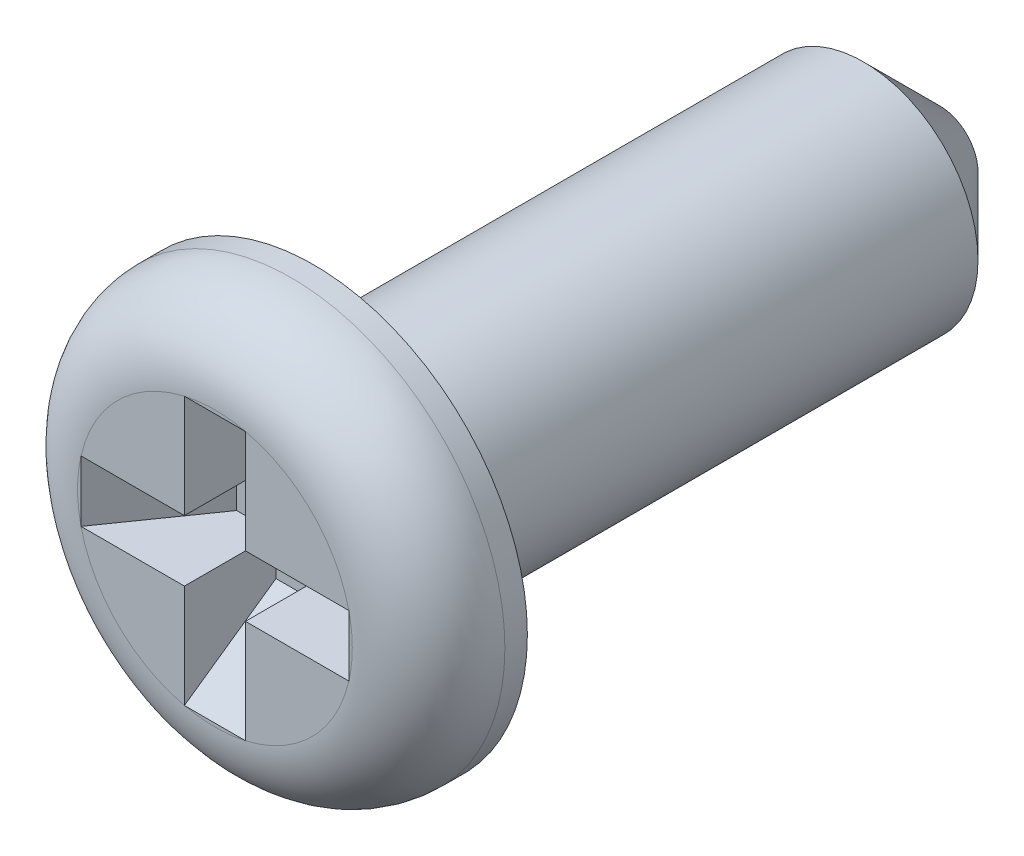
ISO-10303-21;
HEADER;
FILE_DESCRIPTION(('STEP AP214'),'2;1');
FILE_NAME('part.step','',(''),(''),'','','');
FILE_SCHEMA(('AUTOMOTIVE_DESIGN { 1 0 10303 214 1 1 1 1 }'));
ENDSEC;
DATA;
#1=APPLICATION_CONTEXT('core data for automotive mechanical design processes');
#2=APPLICATION_PROTOCOL_DEFINITION('international standard','automotive_design',2000,#1);
#3=PRODUCT_CONTEXT('',#1,'mechanical');
#4=PRODUCT('Part','Part','',(#3));
#5=PRODUCT_RELATED_PRODUCT_CATEGORY('part','',(#4));
#6=PRODUCT_DEFINITION_FORMATION('','',#4);
#7=PRODUCT_DEFINITION_CONTEXT('part definition',#1,'design');
#8=PRODUCT_DEFINITION('design','',#6,#7);
#9=PRODUCT_DEFINITION_SHAPE('','',#8);
#10=(LENGTH_UNIT() NAMED_UNIT(*) SI_UNIT(.MILLI.,.METRE.));
#11=(NAMED_UNIT(*) PLANE_ANGLE_UNIT() SI_UNIT($,.RADIAN.));
#12=(NAMED_UNIT(*) SI_UNIT($,.STERADIAN.) SOLID_ANGLE_UNIT());
#13=UNCERTAINTY_MEASURE_WITH_UNIT(LENGTH_MEASURE(1.E-05),#10,'distance_accuracy_value','');
#14=(GEOMETRIC_REPRESENTATION_CONTEXT(3) GLOBAL_UNCERTAINTY_ASSIGNED_CONTEXT((#13)) GLOBAL_UNIT_ASSIGNED_CONTEXT((#10,
#11,#12)) REPRESENTATION_CONTEXT('',''));
#15=CARTESIAN_POINT('',(0.,0.,0.));
#16=DIRECTION('',(0.,0.,1.));
#17=DIRECTION('',(1.,0.,0.));
#18=AXIS2_PLACEMENT_3D('',#15,#16,#17);
#19=CARTESIAN_POINT('',(0.,1.79999999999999,0.));
#20=DIRECTION('',(0.,0.,-1.));
#21=DIRECTION('',(-1.,0.,0.));
#22=AXIS2_PLACEMENT_3D('',#19,#20,#21);
#23=PLANE('',#22);
#24=CARTESIAN_POINT('',(0.,0.,0.));
#25=DIRECTION('',(0.,0.,1.));
#26=DIRECTION('',(1.,0.,0.));
#27=AXIS2_PLACEMENT_3D('',#24,#25,#26);
#28=CIRCLE('',#27,1.79999999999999);
#29=CARTESIAN_POINT('',(-1.75499287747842,0.4,0.));
#30=VERTEX_POINT('',#29);
#31=CARTESIAN_POINT('',(-1.75499287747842,-0.399999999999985,0.));
#32=VERTEX_POINT('',#31);
#33=EDGE_CURVE('E191',#30,#32,#28,.T.);
#34=ORIENTED_EDGE('',*,*,#33,.T.);
#35=DIRECTION('',(0.,1.,0.));
#36=VECTOR('',#35,1.);
#37=CARTESIAN_POINT('',(-1.75499287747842,1.79999999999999,0.));
#38=LINE('',#37,#36);
#39=EDGE_CURVE('E43',#30,#32,#38,.F.);
#40=ORIENTED_EDGE('',*,*,#39,.F.);
#41=EDGE_LOOP('',(#34,#40));
#42=FACE_BOUND('',#41,.T.);
#43=ADVANCED_FACE('F26',(#42),#23,.F.);
#44=CARTESIAN_POINT('',(-0.399999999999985,1.75499287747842,0.));
#45=VERTEX_POINT('',#44);
#46=EDGE_CURVE('E299',#45,#30,#28,.T.);
#47=ORIENTED_EDGE('',*,*,#46,.T.);
#48=DIRECTION('',(-1.,0.,0.));
#49=VECTOR('',#48,1.);
#50=CARTESIAN_POINT('',(-1.75499287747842,0.4,0.));
#51=LINE('',#50,#49);
#52=CARTESIAN_POINT('',(-0.4,0.4,0.));
#53=VERTEX_POINT('',#52);
#54=EDGE_CURVE('E150',#53,#30,#51,.T.);
#55=ORIENTED_EDGE('',*,*,#54,.F.);
#56=DIRECTION('',(0.,-1.,0.));
#57=VECTOR('',#56,1.);
#58=CARTESIAN_POINT('',(-0.4,1.75499287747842,0.));
#59=LINE('',#58,#57);
#60=EDGE_CURVE('E199',#45,#53,#59,.T.);
#61=ORIENTED_EDGE('',*,*,#60,.F.);
#62=EDGE_LOOP('',(#47,#55,#61));
#63=FACE_BOUND('',#62,.T.);
#64=ADVANCED_FACE('F253',(#63),#23,.F.);
#65=CARTESIAN_POINT('',(0.4,1.75499287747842,0.));
#66=VERTEX_POINT('',#65);
#67=EDGE_CURVE('E301',#66,#45,#28,.T.);
#68=ORIENTED_EDGE('',*,*,#67,.T.);
#69=DIRECTION('',(1.,0.,0.));
#70=VECTOR('',#69,1.);
#71=CARTESIAN_POINT('',(0.,1.75499287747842,0.));
#72=LINE('',#71,#70);
#73=EDGE_CURVE('E211',#66,#45,#72,.F.);
#74=ORIENTED_EDGE('',*,*,#73,.F.);
#75=EDGE_LOOP('',(#68,#74));
#76=FACE_BOUND('',#75,.T.);
#77=ADVANCED_FACE('F261',(#76),#23,.F.);
#78=CARTESIAN_POINT('',(1.75499287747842,0.399999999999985,0.));
#79=VERTEX_POINT('',#78);
#80=EDGE_CURVE('E190',#79,#66,#28,.T.);
#81=ORIENTED_EDGE('',*,*,#80,.T.);
#82=DIRECTION('',(0.,1.,0.));
#83=VECTOR('',#82,1.);
#84=CARTESIAN_POINT('',(0.4,1.75499287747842,0.));
#85=LINE('',#84,#83);
#86=CARTESIAN_POINT('',(0.4,0.4,0.));
#87=VERTEX_POINT('',#86);
#88=EDGE_CURVE('E208',#87,#66,#85,.T.);
#89=ORIENTED_EDGE('',*,*,#88,.F.);
#90=DIRECTION('',(-1.,0.,0.));
#91=VECTOR('',#90,1.);
#92=CARTESIAN_POINT('',(0.4,0.4,0.));
#93=LINE('',#92,#91);
#94=EDGE_CURVE('E212',#79,#87,#93,.T.);
#95=ORIENTED_EDGE('',*,*,#94,.F.);
#96=EDGE_LOOP('',(#81,#89,#95));
#97=FACE_BOUND('',#96,.T.);
#98=ADVANCED_FACE('F318',(#97),#23,.F.);
#99=CARTESIAN_POINT('',(1.75499287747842,-0.4,0.));
#100=VERTEX_POINT('',#99);
#101=EDGE_CURVE('E184',#100,#79,#28,.T.);
#102=ORIENTED_EDGE('',*,*,#101,.T.);
#103=DIRECTION('',(0.,-1.,0.));
#104=VECTOR('',#103,1.);
#105=CARTESIAN_POINT('',(1.75499287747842,1.79999999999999,0.));
#106=LINE('',#105,#104);
#107=EDGE_CURVE('E216',#100,#79,#106,.F.);
#108=ORIENTED_EDGE('',*,*,#107,.F.);
#109=EDGE_LOOP('',(#102,#108));
#110=FACE_BOUND('',#109,.T.);
#111=ADVANCED_FACE('F288',(#110),#23,.F.);
#112=CARTESIAN_POINT('',(0.399999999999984,-1.75499287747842,0.));
#113=VERTEX_POINT('',#112);
#114=EDGE_CURVE('E189',#113,#100,#28,.T.);
#115=ORIENTED_EDGE('',*,*,#114,.T.);
#116=DIRECTION('',(1.,0.,0.));
#117=VECTOR('',#116,1.);
#118=CARTESIAN_POINT('',(0.4,-0.4,0.));
#119=LINE('',#118,#117);
#120=CARTESIAN_POINT('',(0.4,-0.4,0.));
#121=VERTEX_POINT('',#120);
#122=EDGE_CURVE('E207',#121,#100,#119,.T.);
#123=ORIENTED_EDGE('',*,*,#122,.F.);
#124=DIRECTION('',(0.,1.,0.));
#125=VECTOR('',#124,1.);
#126=CARTESIAN_POINT('',(0.4,-0.4,0.));
#127=LINE('',#126,#125);
#128=EDGE_CURVE('E204',#113,#121,#127,.T.);
#129=ORIENTED_EDGE('',*,*,#128,.F.);
#130=EDGE_LOOP('',(#115,#123,#129));
#131=FACE_BOUND('',#130,.T.);
#132=ADVANCED_FACE('F281',(#131),#23,.F.);
#133=CARTESIAN_POINT('',(-0.4,-1.75499287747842,0.));
#134=VERTEX_POINT('',#133);
#135=EDGE_CURVE('E185',#134,#113,#28,.T.);
#136=ORIENTED_EDGE('',*,*,#135,.T.);
#137=DIRECTION('',(-1.,0.,0.));
#138=VECTOR('',#137,1.);
#139=CARTESIAN_POINT('',(0.,-1.75499287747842,0.));
#140=LINE('',#139,#138);
#141=EDGE_CURVE('E203',#134,#113,#140,.F.);
#142=ORIENTED_EDGE('',*,*,#141,.F.);
#143=EDGE_LOOP('',(#136,#142));
#144=FACE_BOUND('',#143,.T.);
#145=ADVANCED_FACE('F269',(#144),#23,.F.);
#146=CARTESIAN_POINT('',(0.,2.8,-1.29465791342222));
#147=DIRECTION('',(0.,0.,1.));
#148=DIRECTION('',(1.,0.,0.));
#149=AXIS2_PLACEMENT_3D('',#146,#147,#148);
#150=PLANE('',#149);
#151=CARTESIAN_POINT('',(0.,0.,-1.29465791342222));
#152=DIRECTION('',(0.,0.,1.));
#153=DIRECTION('',(1.,0.,0.));
#154=AXIS2_PLACEMENT_3D('',#151,#152,#153);
#155=CIRCLE('',#154,1.5);
#156=CARTESIAN_POINT('',(1.5,0.,-1.29465791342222));
#157=VERTEX_POINT('',#156);
#158=EDGE_CURVE('E181',#157,#157,#155,.T.);
#159=ORIENTED_EDGE('',*,*,#158,.T.);
#160=EDGE_LOOP('',(#159));
#161=FACE_BOUND('',#160,.T.);
#162=CARTESIAN_POINT('',(0.,0.,-1.29465791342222));
#163=DIRECTION('',(0.,0.,1.));
#164=DIRECTION('',(1.,0.,0.));
#165=AXIS2_PLACEMENT_3D('',#162,#163,#164);
#166=CIRCLE('',#165,2.8);
#167=CARTESIAN_POINT('',(2.8,0.,-1.29465791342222));
#168=VERTEX_POINT('',#167);
#169=EDGE_CURVE('E195',#168,#168,#166,.T.);
#170=ORIENTED_EDGE('',*,*,#169,.F.);
#171=EDGE_LOOP('',(#170));
#172=FACE_BOUND('',#171,.T.);
#173=ADVANCED_FACE('F280',(#161,#172),#150,.F.);
#174=CARTESIAN_POINT('',(0.,0.,1.60350842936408));
#175=DIRECTION('',(0.,0.,1.));
#176=DIRECTION('',(1.,0.,0.));
#177=AXIS2_PLACEMENT_3D('',#174,#175,#176);
#178=CYLINDRICAL_SURFACE('',#177,2.8);
#179=CARTESIAN_POINT('',(0.,0.,-1.00000000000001));
#180=DIRECTION('',(0.,0.,1.));
#181=DIRECTION('',(1.,0.,0.));
#182=AXIS2_PLACEMENT_3D('',#179,#180,#181);
#183=CIRCLE('',#182,2.8);
#184=CARTESIAN_POINT('',(2.8,0.,-1.00000000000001));
#185=VERTEX_POINT('',#184);
#186=EDGE_CURVE('E192',#185,#185,#183,.T.);
#187=ORIENTED_EDGE('',*,*,#186,.F.);
#188=EDGE_LOOP('',(#187));
#189=FACE_BOUND('',#188,.T.);
#190=ORIENTED_EDGE('',*,*,#169,.T.);
#191=EDGE_LOOP('',(#190));
#192=FACE_BOUND('',#191,.T.);
#193=ADVANCED_FACE('F276',(#189,#192),#178,.T.);
#194=CARTESIAN_POINT('',(0.,0.,-1.));
#195=DIRECTION('',(0.,0.,1.));
#196=DIRECTION('',(1.,0.,0.));
#197=AXIS2_PLACEMENT_3D('',#194,#195,#196);
#198=TOROIDAL_SURFACE('',#197,1.8,1.);
#199=ORIENTED_EDGE('',*,*,#80,.F.);
#200=ORIENTED_EDGE('',*,*,#101,.F.);
#201=ORIENTED_EDGE('',*,*,#114,.F.);
#202=ORIENTED_EDGE('',*,*,#135,.F.);
#203=EDGE_CURVE('E188',#32,#134,#28,.T.);
#204=ORIENTED_EDGE('',*,*,#203,.F.);
#205=ORIENTED_EDGE('',*,*,#33,.F.);
#206=ORIENTED_EDGE('',*,*,#46,.F.);
#207=ORIENTED_EDGE('',*,*,#67,.F.);
#208=EDGE_LOOP('',(#199,#200,#201,#202,#204,#205,#206,#207));
#209=FACE_BOUND('',#208,.T.);
#210=ORIENTED_EDGE('',*,*,#186,.T.);
#211=EDGE_LOOP('',(#210));
#212=FACE_BOUND('',#211,.T.);
#213=ADVANCED_FACE('F267',(#209,#212),#198,.T.);
#214=ORIENTED_EDGE('',*,*,#203,.T.);
#215=DIRECTION('',(0.,-1.,0.));
#216=VECTOR('',#215,1.);
#217=CARTESIAN_POINT('',(-0.4,-0.4,0.));
#218=LINE('',#217,#216);
#219=CARTESIAN_POINT('',(-0.4,-0.4,0.));
#220=VERTEX_POINT('',#219);
#221=EDGE_CURVE('E201',#220,#134,#218,.T.);
#222=ORIENTED_EDGE('',*,*,#221,.F.);
#223=DIRECTION('',(1.,0.,0.));
#224=VECTOR('',#223,1.);
#225=CARTESIAN_POINT('',(-1.75499287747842,-0.4,0.));
#226=LINE('',#225,#224);
#227=EDGE_CURVE('E131',#32,#220,#226,.T.);
#228=ORIENTED_EDGE('',*,*,#227,.F.);
#229=EDGE_LOOP('',(#214,#222,#228));
#230=FACE_BOUND('',#229,.T.);
#231=ADVANCED_FACE('F256',(#230),#23,.F.);
#232=CARTESIAN_POINT('',(0.,0.,-9.5));
#233=DIRECTION('',(0.,0.,1.));
#234=DIRECTION('',(1.,0.,0.));
#235=AXIS2_PLACEMENT_3D('',#232,#233,#234);
#236=CYLINDRICAL_SURFACE('',#235,1.5);
#237=CARTESIAN_POINT('',(0.,0.,-8.5));
#238=DIRECTION('',(0.,0.,1.));
#239=DIRECTION('',(1.,0.,0.));
#240=AXIS2_PLACEMENT_3D('',#237,#238,#239);
#241=CIRCLE('',#240,1.5);
#242=CARTESIAN_POINT('',(1.5,0.,-8.5));
#243=VERTEX_POINT('',#242);
#244=EDGE_CURVE('E35',#243,#243,#241,.T.);
#245=ORIENTED_EDGE('',*,*,#244,.T.);
#246=EDGE_LOOP('',(#245));
#247=FACE_BOUND('',#246,.T.);
#248=ORIENTED_EDGE('',*,*,#158,.F.);
#249=EDGE_LOOP('',(#248));
#250=FACE_BOUND('',#249,.T.);
#251=ADVANCED_FACE('F239',(#247,#250),#236,.T.);
#252=CARTESIAN_POINT('',(0.,0.,-9.5));
#253=DIRECTION('',(0.,0.,1.));
#254=DIRECTION('',(1.,0.,0.));
#255=AXIS2_PLACEMENT_3D('',#252,#253,#254);
#256=PLANE('',#255);
#257=CARTESIAN_POINT('',(0.,0.,-9.5));
#258=DIRECTION('',(0.,0.,1.));
#259=DIRECTION('',(1.,0.,0.));
#260=AXIS2_PLACEMENT_3D('',#257,#258,#259);
#261=CIRCLE('',#260,0.499999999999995);
#262=CARTESIAN_POINT('',(0.499999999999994,0.,-9.5));
#263=VERTEX_POINT('',#262);
#264=EDGE_CURVE('E11',#263,#263,#261,.F.);
#265=ORIENTED_EDGE('',*,*,#264,.T.);
#266=EDGE_LOOP('',(#265));
#267=FACE_BOUND('',#266,.T.);
#268=ADVANCED_FACE('F275',(#267),#256,.F.);
#269=CARTESIAN_POINT('',(-1.75499287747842,1.79999999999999,0.));
#270=DIRECTION('',(0.819152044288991,0.,0.573576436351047));
#271=DIRECTION('',(0.573576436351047,0.,-0.819152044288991));
#272=AXIS2_PLACEMENT_3D('',#269,#270,#271);
#273=PLANE('',#272);
#274=ORIENTED_EDGE('',*,*,#39,.T.);
#275=DIRECTION('',(0.573576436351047,0.,-0.819152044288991));
#276=VECTOR('',#275,1.);
#277=CARTESIAN_POINT('',(-1.75499287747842,-0.4,0.));
#278=LINE('',#277,#276);
#279=CARTESIAN_POINT('',(-0.91474383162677,-0.4,-1.2));
#280=VERTEX_POINT('',#279);
#281=EDGE_CURVE('E136',#280,#32,#278,.F.);
#282=ORIENTED_EDGE('',*,*,#281,.F.);
#283=DIRECTION('',(0.,1.,0.));
#284=VECTOR('',#283,1.);
#285=CARTESIAN_POINT('',(-0.91474383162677,1.79999999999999,-1.2));
#286=LINE('',#285,#284);
#287=CARTESIAN_POINT('',(-0.91474383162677,0.4,-1.2));
#288=VERTEX_POINT('',#287);
#289=EDGE_CURVE('E148',#288,#280,#286,.F.);
#290=ORIENTED_EDGE('',*,*,#289,.F.);
#291=DIRECTION('',(0.573576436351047,0.,-0.819152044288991));
#292=VECTOR('',#291,1.);
#293=CARTESIAN_POINT('',(-1.19117730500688,0.4,-0.8052120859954));
#294=LINE('',#293,#292);
#295=EDGE_CURVE('E109',#288,#30,#294,.F.);
#296=ORIENTED_EDGE('',*,*,#295,.T.);
#297=EDGE_LOOP('',(#274,#282,#290,#296));
#298=FACE_BOUND('',#297,.T.);
#299=ADVANCED_FACE('F348',(#298),#273,.T.);
#300=CARTESIAN_POINT('',(-1.75499287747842,0.4,-1.2));
#301=DIRECTION('',(0.,1.,0.));
#302=DIRECTION('',(-1.,0.,0.));
#303=AXIS2_PLACEMENT_3D('',#300,#301,#302);
#304=PLANE('',#303);
#305=ORIENTED_EDGE('',*,*,#54,.T.);
#306=ORIENTED_EDGE('',*,*,#295,.F.);
#307=DIRECTION('',(-1.,0.,0.));
#308=VECTOR('',#307,1.);
#309=CARTESIAN_POINT('',(-1.75499287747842,0.4,-1.2));
#310=LINE('',#309,#308);
#311=CARTESIAN_POINT('',(-0.4,0.4,-1.2));
#312=VERTEX_POINT('',#311);
#313=EDGE_CURVE('E170',#312,#288,#310,.T.);
#314=ORIENTED_EDGE('',*,*,#313,.F.);
#315=DIRECTION('',(0.,0.,1.));
#316=VECTOR('',#315,1.);
#317=CARTESIAN_POINT('',(-0.4,0.4,-1.2));
#318=LINE('',#317,#316);
#319=EDGE_CURVE('E115',#312,#53,#318,.T.);
#320=ORIENTED_EDGE('',*,*,#319,.T.);
#321=EDGE_LOOP('',(#305,#306,#314,#320));
#322=FACE_BOUND('',#321,.T.);
#323=ADVANCED_FACE('F352',(#322),#304,.F.);
#324=CARTESIAN_POINT('',(-0.4,1.75499287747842,-1.2));
#325=DIRECTION('',(-1.,0.,0.));
#326=DIRECTION('',(0.,-1.,0.));
#327=AXIS2_PLACEMENT_3D('',#324,#325,#326);
#328=PLANE('',#327);
#329=ORIENTED_EDGE('',*,*,#60,.T.);
#330=ORIENTED_EDGE('',*,*,#319,.F.);
#331=DIRECTION('',(0.,-1.,0.));
#332=VECTOR('',#331,1.);
#333=CARTESIAN_POINT('',(-0.4,1.75499287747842,-1.2));
#334=LINE('',#333,#332);
#335=CARTESIAN_POINT('',(-0.4,0.91474383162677,-1.2));
#336=VERTEX_POINT('',#335);
#337=EDGE_CURVE('E167',#336,#312,#334,.T.);
#338=ORIENTED_EDGE('',*,*,#337,.F.);
#339=DIRECTION('',(0.,-0.573576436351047,-0.819152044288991));
#340=VECTOR('',#339,1.);
#341=CARTESIAN_POINT('',(-0.4,1.75499287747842,0.));
#342=LINE('',#341,#340);
#343=EDGE_CURVE('E173',#336,#45,#342,.F.);
#344=ORIENTED_EDGE('',*,*,#343,.T.);
#345=EDGE_LOOP('',(#329,#330,#338,#344));
#346=FACE_BOUND('',#345,.T.);
#347=ADVANCED_FACE('F357',(#346),#328,.F.);
#348=CARTESIAN_POINT('',(0.,1.75499287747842,0.));
#349=DIRECTION('',(0.,-0.819152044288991,0.573576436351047));
#350=DIRECTION('',(0.,-0.573576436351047,-0.819152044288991));
#351=AXIS2_PLACEMENT_3D('',#348,#349,#350);
#352=PLANE('',#351);
#353=ORIENTED_EDGE('',*,*,#73,.T.);
#354=ORIENTED_EDGE('',*,*,#343,.F.);
#355=DIRECTION('',(1.,0.,0.));
#356=VECTOR('',#355,1.);
#357=CARTESIAN_POINT('',(0.,0.91474383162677,-1.2));
#358=LINE('',#357,#356);
#359=CARTESIAN_POINT('',(0.4,0.91474383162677,-1.2));
#360=VERTEX_POINT('',#359);
#361=EDGE_CURVE('E166',#360,#336,#358,.F.);
#362=ORIENTED_EDGE('',*,*,#361,.F.);
#363=DIRECTION('',(0.,-0.573576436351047,-0.819152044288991));
#364=VECTOR('',#363,1.);
#365=CARTESIAN_POINT('',(0.4,1.19117730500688,-0.8052120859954));
#366=LINE('',#365,#364);
#367=EDGE_CURVE('E175',#360,#66,#366,.F.);
#368=ORIENTED_EDGE('',*,*,#367,.T.);
#369=EDGE_LOOP('',(#353,#354,#362,#368));
#370=FACE_BOUND('',#369,.T.);
#371=ADVANCED_FACE('F362',(#370),#352,.T.);
#372=CARTESIAN_POINT('',(0.4,1.75499287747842,-1.2));
#373=DIRECTION('',(1.,0.,0.));
#374=DIRECTION('',(0.,0.,-1.));
#375=AXIS2_PLACEMENT_3D('',#372,#373,#374);
#376=PLANE('',#375);
#377=ORIENTED_EDGE('',*,*,#88,.T.);
#378=ORIENTED_EDGE('',*,*,#367,.F.);
#379=DIRECTION('',(0.,1.,0.));
#380=VECTOR('',#379,1.);
#381=CARTESIAN_POINT('',(0.4,1.75499287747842,-1.2));
#382=LINE('',#381,#380);
#383=CARTESIAN_POINT('',(0.4,0.4,-1.2));
#384=VERTEX_POINT('',#383);
#385=EDGE_CURVE('E163',#384,#360,#382,.T.);
#386=ORIENTED_EDGE('',*,*,#385,.F.);
#387=DIRECTION('',(0.,0.,1.));
#388=VECTOR('',#387,1.);
#389=CARTESIAN_POINT('',(0.4,0.4,-1.2));
#390=LINE('',#389,#388);
#391=EDGE_CURVE('E100',#384,#87,#390,.T.);
#392=ORIENTED_EDGE('',*,*,#391,.T.);
#393=EDGE_LOOP('',(#377,#378,#386,#392));
#394=FACE_BOUND('',#393,.T.);
#395=ADVANCED_FACE('F321',(#394),#376,.F.);
#396=CARTESIAN_POINT('',(0.4,0.4,-1.2));
#397=DIRECTION('',(0.,1.,0.));
#398=DIRECTION('',(-1.,0.,0.));
#399=AXIS2_PLACEMENT_3D('',#396,#397,#398);
#400=PLANE('',#399);
#401=ORIENTED_EDGE('',*,*,#94,.T.);
#402=ORIENTED_EDGE('',*,*,#391,.F.);
#403=DIRECTION('',(-1.,0.,0.));
#404=VECTOR('',#403,1.);
#405=CARTESIAN_POINT('',(0.4,0.4,-1.2));
#406=LINE('',#405,#404);
#407=CARTESIAN_POINT('',(0.91474383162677,0.4,-1.2));
#408=VERTEX_POINT('',#407);
#409=EDGE_CURVE('E160',#408,#384,#406,.T.);
#410=ORIENTED_EDGE('',*,*,#409,.F.);
#411=DIRECTION('',(-0.573576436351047,0.,-0.819152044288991));
#412=VECTOR('',#411,1.);
#413=CARTESIAN_POINT('',(1.75499287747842,0.4,0.));
#414=LINE('',#413,#412);
#415=EDGE_CURVE('E93',#408,#79,#414,.F.);
#416=ORIENTED_EDGE('',*,*,#415,.T.);
#417=EDGE_LOOP('',(#401,#402,#410,#416));
#418=FACE_BOUND('',#417,.T.);
#419=ADVANCED_FACE('F319',(#418),#400,.F.);
#420=CARTESIAN_POINT('',(1.75499287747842,1.79999999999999,0.));
#421=DIRECTION('',(-0.819152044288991,0.,0.573576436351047));
#422=DIRECTION('',(0.573576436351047,0.,0.819152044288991));
#423=AXIS2_PLACEMENT_3D('',#420,#421,#422);
#424=PLANE('',#423);
#425=ORIENTED_EDGE('',*,*,#107,.T.);
#426=ORIENTED_EDGE('',*,*,#415,.F.);
#427=DIRECTION('',(0.,-1.,0.));
#428=VECTOR('',#427,1.);
#429=CARTESIAN_POINT('',(0.91474383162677,1.79999999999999,-1.2));
#430=LINE('',#429,#428);
#431=CARTESIAN_POINT('',(0.91474383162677,-0.4,-1.2));
#432=VERTEX_POINT('',#431);
#433=EDGE_CURVE('E159',#432,#408,#430,.F.);
#434=ORIENTED_EDGE('',*,*,#433,.F.);
#435=DIRECTION('',(-0.573576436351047,0.,-0.819152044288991));
#436=VECTOR('',#435,1.);
#437=CARTESIAN_POINT('',(0.74539829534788,-0.4,-1.44185049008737));
#438=LINE('',#437,#436);
#439=EDGE_CURVE('E178',#432,#100,#438,.F.);
#440=ORIENTED_EDGE('',*,*,#439,.T.);
#441=EDGE_LOOP('',(#425,#426,#434,#440));
#442=FACE_BOUND('',#441,.T.);
#443=ADVANCED_FACE('F324',(#442),#424,.T.);
#444=CARTESIAN_POINT('',(0.4,-0.4,-1.2));
#445=DIRECTION('',(0.,-1.,0.));
#446=DIRECTION('',(1.,0.,0.));
#447=AXIS2_PLACEMENT_3D('',#444,#445,#446);
#448=PLANE('',#447);
#449=ORIENTED_EDGE('',*,*,#122,.T.);
#450=ORIENTED_EDGE('',*,*,#439,.F.);
#451=DIRECTION('',(1.,0.,0.));
#452=VECTOR('',#451,1.);
#453=CARTESIAN_POINT('',(0.4,-0.4,-1.2));
#454=LINE('',#453,#452);
#455=CARTESIAN_POINT('',(0.4,-0.4,-1.2));
#456=VERTEX_POINT('',#455);
#457=EDGE_CURVE('E156',#456,#432,#454,.T.);
#458=ORIENTED_EDGE('',*,*,#457,.F.);
#459=DIRECTION('',(0.,0.,1.));
#460=VECTOR('',#459,1.);
#461=CARTESIAN_POINT('',(0.4,-0.4,-1.2));
#462=LINE('',#461,#460);
#463=EDGE_CURVE('E176',#456,#121,#462,.T.);
#464=ORIENTED_EDGE('',*,*,#463,.T.);
#465=EDGE_LOOP('',(#449,#450,#458,#464));
#466=FACE_BOUND('',#465,.T.);
#467=ADVANCED_FACE('F326',(#466),#448,.F.);
#468=CARTESIAN_POINT('',(0.4,-0.4,-1.2));
#469=DIRECTION('',(1.,0.,0.));
#470=DIRECTION('',(0.,1.,0.));
#471=AXIS2_PLACEMENT_3D('',#468,#469,#470);
#472=PLANE('',#471);
#473=ORIENTED_EDGE('',*,*,#128,.T.);
#474=ORIENTED_EDGE('',*,*,#463,.F.);
#475=DIRECTION('',(0.,1.,0.));
#476=VECTOR('',#475,1.);
#477=CARTESIAN_POINT('',(0.4,-0.4,-1.2));
#478=LINE('',#477,#476);
#479=CARTESIAN_POINT('',(0.4,-0.91474383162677,-1.2));
#480=VERTEX_POINT('',#479);
#481=EDGE_CURVE('E153',#480,#456,#478,.T.);
#482=ORIENTED_EDGE('',*,*,#481,.F.);
#483=DIRECTION('',(0.,0.573576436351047,-0.819152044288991));
#484=VECTOR('',#483,1.);
#485=CARTESIAN_POINT('',(0.4,-1.75499287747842,0.));
#486=LINE('',#485,#484);
#487=EDGE_CURVE('E179',#480,#113,#486,.F.);
#488=ORIENTED_EDGE('',*,*,#487,.T.);
#489=EDGE_LOOP('',(#473,#474,#482,#488));
#490=FACE_BOUND('',#489,.T.);
#491=ADVANCED_FACE('F330',(#490),#472,.F.);
#492=CARTESIAN_POINT('',(0.,-1.75499287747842,0.));
#493=DIRECTION('',(0.,0.819152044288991,0.573576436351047));
#494=DIRECTION('',(0.,-0.573576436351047,0.819152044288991));
#495=AXIS2_PLACEMENT_3D('',#492,#493,#494);
#496=PLANE('',#495);
#497=ORIENTED_EDGE('',*,*,#141,.T.);
#498=ORIENTED_EDGE('',*,*,#487,.F.);
#499=DIRECTION('',(-1.,0.,0.));
#500=VECTOR('',#499,1.);
#501=CARTESIAN_POINT('',(0.,-0.91474383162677,-1.2));
#502=LINE('',#501,#500);
#503=CARTESIAN_POINT('',(-0.4,-0.91474383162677,-1.2));
#504=VERTEX_POINT('',#503);
#505=EDGE_CURVE('E144',#504,#480,#502,.F.);
#506=ORIENTED_EDGE('',*,*,#505,.F.);
#507=DIRECTION('',(0.,0.573576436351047,-0.819152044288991));
#508=VECTOR('',#507,1.);
#509=CARTESIAN_POINT('',(-0.4,-0.74539829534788,-1.44185049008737));
#510=LINE('',#509,#508);
#511=EDGE_CURVE('E135',#504,#134,#510,.F.);
#512=ORIENTED_EDGE('',*,*,#511,.T.);
#513=EDGE_LOOP('',(#497,#498,#506,#512));
#514=FACE_BOUND('',#513,.T.);
#515=ADVANCED_FACE('F28',(#514),#496,.T.);
#516=CARTESIAN_POINT('',(-0.4,-0.4,-1.2));
#517=DIRECTION('',(-1.,0.,0.));
#518=DIRECTION('',(0.,-1.,0.));
#519=AXIS2_PLACEMENT_3D('',#516,#517,#518);
#520=PLANE('',#519);
#521=ORIENTED_EDGE('',*,*,#221,.T.);
#522=ORIENTED_EDGE('',*,*,#511,.F.);
#523=DIRECTION('',(0.,-1.,0.));
#524=VECTOR('',#523,1.);
#525=CARTESIAN_POINT('',(-0.4,-0.4,-1.2));
#526=LINE('',#525,#524);
#527=CARTESIAN_POINT('',(-0.4,-0.4,-1.2));
#528=VERTEX_POINT('',#527);
#529=EDGE_CURVE('E139',#528,#504,#526,.T.);
#530=ORIENTED_EDGE('',*,*,#529,.F.);
#531=DIRECTION('',(0.,0.,1.));
#532=VECTOR('',#531,1.);
#533=CARTESIAN_POINT('',(-0.4,-0.4,-1.2));
#534=LINE('',#533,#532);
#535=EDGE_CURVE('E124',#528,#220,#534,.T.);
#536=ORIENTED_EDGE('',*,*,#535,.T.);
#537=EDGE_LOOP('',(#521,#522,#530,#536));
#538=FACE_BOUND('',#537,.T.);
#539=ADVANCED_FACE('F140',(#538),#520,.F.);
#540=CARTESIAN_POINT('',(-1.75499287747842,-0.4,-1.2));
#541=DIRECTION('',(0.,-1.,0.));
#542=DIRECTION('',(1.,0.,0.));
#543=AXIS2_PLACEMENT_3D('',#540,#541,#542);
#544=PLANE('',#543);
#545=ORIENTED_EDGE('',*,*,#227,.T.);
#546=ORIENTED_EDGE('',*,*,#535,.F.);
#547=DIRECTION('',(1.,0.,0.));
#548=VECTOR('',#547,1.);
#549=CARTESIAN_POINT('',(-1.75499287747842,-0.4,-1.2));
#550=LINE('',#549,#548);
#551=EDGE_CURVE('E128',#280,#528,#550,.T.);
#552=ORIENTED_EDGE('',*,*,#551,.F.);
#553=ORIENTED_EDGE('',*,*,#281,.T.);
#554=EDGE_LOOP('',(#545,#546,#552,#553));
#555=FACE_BOUND('',#554,.T.);
#556=ADVANCED_FACE('F126',(#555),#544,.F.);
#557=CARTESIAN_POINT('',(-1.75499287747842,1.75499287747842,-1.2));
#558=DIRECTION('',(0.,0.,-1.));
#559=DIRECTION('',(-1.,0.,0.));
#560=AXIS2_PLACEMENT_3D('',#557,#558,#559);
#561=PLANE('',#560);
#562=ORIENTED_EDGE('',*,*,#289,.T.);
#563=ORIENTED_EDGE('',*,*,#551,.T.);
#564=ORIENTED_EDGE('',*,*,#529,.T.);
#565=ORIENTED_EDGE('',*,*,#505,.T.);
#566=ORIENTED_EDGE('',*,*,#481,.T.);
#567=ORIENTED_EDGE('',*,*,#457,.T.);
#568=ORIENTED_EDGE('',*,*,#433,.T.);
#569=ORIENTED_EDGE('',*,*,#409,.T.);
#570=ORIENTED_EDGE('',*,*,#385,.T.);
#571=ORIENTED_EDGE('',*,*,#361,.T.);
#572=ORIENTED_EDGE('',*,*,#337,.T.);
#573=ORIENTED_EDGE('',*,*,#313,.T.);
#574=EDGE_LOOP('',(#562,#563,#564,#565,#566,#567,#568,#569,#570,#571,#572,#573));
#575=FACE_BOUND('',#574,.T.);
#576=ADVANCED_FACE('F146',(#575),#561,.F.);
#577=CARTESIAN_POINT('',(0.,0.,-8.5));
#578=DIRECTION('',(0.,0.,1.));
#579=DIRECTION('',(1.,0.,0.));
#580=AXIS2_PLACEMENT_3D('',#577,#578,#579);
#581=CONICAL_SURFACE('',#580,1.5,0.78539816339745);
#582=CARTESIAN_POINT('',(0.499999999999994,0.,-9.5));
#583=CARTESIAN_POINT('',(0.510416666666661,0.,-9.48958333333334));
#584=CARTESIAN_POINT('',(0.520833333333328,0.,-9.47916666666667));
#585=CARTESIAN_POINT('',(0.541666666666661,0.,-9.45833333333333));
#586=CARTESIAN_POINT('',(0.552083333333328,0.,-9.44791666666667));
#587=CARTESIAN_POINT('',(0.572916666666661,0.,-9.42708333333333));
#588=CARTESIAN_POINT('',(0.583333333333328,0.,-9.41666666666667));
#589=CARTESIAN_POINT('',(0.604166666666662,0.,-9.39583333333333));
#590=CARTESIAN_POINT('',(0.614583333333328,0.,-9.38541666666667));
#591=CARTESIAN_POINT('',(0.635416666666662,0.,-9.36458333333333));
#592=CARTESIAN_POINT('',(0.645833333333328,0.,-9.35416666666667));
#593=CARTESIAN_POINT('',(0.666666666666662,0.,-9.33333333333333));
#594=CARTESIAN_POINT('',(0.677083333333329,0.,-9.32291666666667));
#595=CARTESIAN_POINT('',(0.697916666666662,0.,-9.30208333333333));
#596=CARTESIAN_POINT('',(0.708333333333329,0.,-9.29166666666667));
#597=CARTESIAN_POINT('',(0.729166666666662,0.,-9.27083333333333));
#598=CARTESIAN_POINT('',(0.739583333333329,0.,-9.26041666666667));
#599=CARTESIAN_POINT('',(0.760416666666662,0.,-9.23958333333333));
#600=CARTESIAN_POINT('',(0.770833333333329,0.,-9.22916666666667));
#601=CARTESIAN_POINT('',(0.791666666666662,0.,-9.20833333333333));
#602=CARTESIAN_POINT('',(0.802083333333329,0.,-9.19791666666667));
#603=CARTESIAN_POINT('',(0.822916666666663,0.,-9.17708333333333));
#604=CARTESIAN_POINT('',(0.833333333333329,0.,-9.16666666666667));
#605=CARTESIAN_POINT('',(0.854166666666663,0.,-9.14583333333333));
#606=CARTESIAN_POINT('',(0.864583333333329,0.,-9.13541666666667));
#607=CARTESIAN_POINT('',(0.885416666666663,0.,-9.11458333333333));
#608=CARTESIAN_POINT('',(0.89583333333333,0.,-9.10416666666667));
#609=CARTESIAN_POINT('',(0.916666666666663,0.,-9.08333333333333));
#610=CARTESIAN_POINT('',(0.92708333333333,0.,-9.07291666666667));
#611=CARTESIAN_POINT('',(0.947916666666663,0.,-9.05208333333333));
#612=CARTESIAN_POINT('',(0.95833333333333,0.,-9.04166666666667));
#613=CARTESIAN_POINT('',(0.979166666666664,0.,-9.02083333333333));
#614=CARTESIAN_POINT('',(0.98958333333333,0.,-9.01041666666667));
#615=CARTESIAN_POINT('',(1.01041666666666,0.,-8.98958333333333));
#616=CARTESIAN_POINT('',(1.02083333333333,0.,-8.97916666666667));
#617=CARTESIAN_POINT('',(1.04166666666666,0.,-8.95833333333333));
#618=CARTESIAN_POINT('',(1.05208333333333,0.,-8.94791666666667));
#619=CARTESIAN_POINT('',(1.07291666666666,0.,-8.92708333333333));
#620=CARTESIAN_POINT('',(1.08333333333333,0.,-8.91666666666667));
#621=CARTESIAN_POINT('',(1.10416666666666,0.,-8.89583333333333));
#622=CARTESIAN_POINT('',(1.11458333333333,0.,-8.88541666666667));
#623=CARTESIAN_POINT('',(1.13541666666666,0.,-8.86458333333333));
#624=CARTESIAN_POINT('',(1.14583333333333,0.,-8.85416666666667));
#625=CARTESIAN_POINT('',(1.16666666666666,0.,-8.83333333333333));
#626=CARTESIAN_POINT('',(1.17708333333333,0.,-8.82291666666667));
#627=CARTESIAN_POINT('',(1.19791666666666,0.,-8.80208333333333));
#628=CARTESIAN_POINT('',(1.20833333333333,0.,-8.79166666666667));
#629=CARTESIAN_POINT('',(1.22916666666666,0.,-8.77083333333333));
#630=CARTESIAN_POINT('',(1.23958333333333,0.,-8.76041666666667));
#631=CARTESIAN_POINT('',(1.26041666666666,0.,-8.73958333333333));
#632=CARTESIAN_POINT('',(1.27083333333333,0.,-8.72916666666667));
#633=CARTESIAN_POINT('',(1.29166666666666,0.,-8.70833333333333));
#634=CARTESIAN_POINT('',(1.30208333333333,0.,-8.69791666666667));
#635=CARTESIAN_POINT('',(1.32291666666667,0.,-8.67708333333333));
#636=CARTESIAN_POINT('',(1.33333333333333,0.,-8.66666666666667));
#637=CARTESIAN_POINT('',(1.35416666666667,0.,-8.64583333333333));
#638=CARTESIAN_POINT('',(1.36458333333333,0.,-8.63541666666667));
#639=CARTESIAN_POINT('',(1.38541666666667,0.,-8.61458333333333));
#640=CARTESIAN_POINT('',(1.39583333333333,0.,-8.60416666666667));
#641=CARTESIAN_POINT('',(1.41666666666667,0.,-8.58333333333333));
#642=CARTESIAN_POINT('',(1.42708333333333,0.,-8.57291666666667));
#643=CARTESIAN_POINT('',(1.44791666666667,0.,-8.55208333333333));
#644=CARTESIAN_POINT('',(1.45833333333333,0.,-8.54166666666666));
#645=CARTESIAN_POINT('',(1.47916666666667,0.,-8.52083333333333));
#646=CARTESIAN_POINT('',(1.48958333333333,0.,-8.51041666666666));
#647=CARTESIAN_POINT('',(1.5,0.,-8.5));
#648=B_SPLINE_CURVE_WITH_KNOTS('',3,(#582,#583,#584,#585,#586,#587,#588,#589,#590,#591,#592,
#593,#594,#595,#596,#597,#598,#599,#600,#601,#602,#603,#604,#605,#606,#607,#608,#609,#610,#611,
#612,#613,#614,#615,#616,#617,#618,#619,#620,#621,#622,#623,#624,#625,#626,#627,#628,#629,#630,
#631,#632,#633,#634,#635,#636,#637,#638,#639,#640,#641,#642,#643,#644,#645,#646,#647),
.UNSPECIFIED.,.F.,.F.,(4,2,2,2,2,2,2,2,2,2,2,2,2,2,2,2,2,2,2,2,2,2,2,2,2,2,2,2,2,2,2,2,4),(0.,
0.0441941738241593,0.0883883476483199,0.132582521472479,0.176776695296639,0.220970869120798,
0.265165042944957,0.309359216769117,0.353553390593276,0.397747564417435,0.441941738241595,
0.486135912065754,0.530330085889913,0.574524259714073,0.618718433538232,0.662912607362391,
0.707106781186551,0.75130095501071,0.795495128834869,0.839689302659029,0.883883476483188,
0.928077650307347,0.972271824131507,1.01646599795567,1.06066017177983,1.10485434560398,
1.14904851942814,1.1932426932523,1.23743686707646,1.28163104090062,1.32582521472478,
1.37001938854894,1.4142135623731),.UNSPECIFIED.);
#649=EDGE_CURVE('BSEAM242',#263,#243,#648,.T.);
#650=ORIENTED_EDGE('',*,*,#264,.F.);
#651=ORIENTED_EDGE('',*,*,#244,.F.);
#652=ORIENTED_EDGE('',*,*,#649,.T.);
#653=ORIENTED_EDGE('',*,*,#649,.F.);
#654=EDGE_LOOP('',(#650,#652,#651,#653));
#655=FACE_BOUND('',#654,.T.);
#656=ADVANCED_FACE('F242',(#655),#581,.T.);
#657=CLOSED_SHELL('',(#43,#64,#77,#98,#111,#132,#145,#173,#193,#213,#231,#251,#268,#299,#323,
#347,#371,#395,#419,#443,#467,#491,#515,#539,#556,#576,#656));
#658=MANIFOLD_SOLID_BREP('B2',#657);
#659=ADVANCED_BREP_SHAPE_REPRESENTATION('',(#18,#658),#14);
#660=SHAPE_DEFINITION_REPRESENTATION(#9,#659);
ENDSEC;
END-ISO-10303-21;
